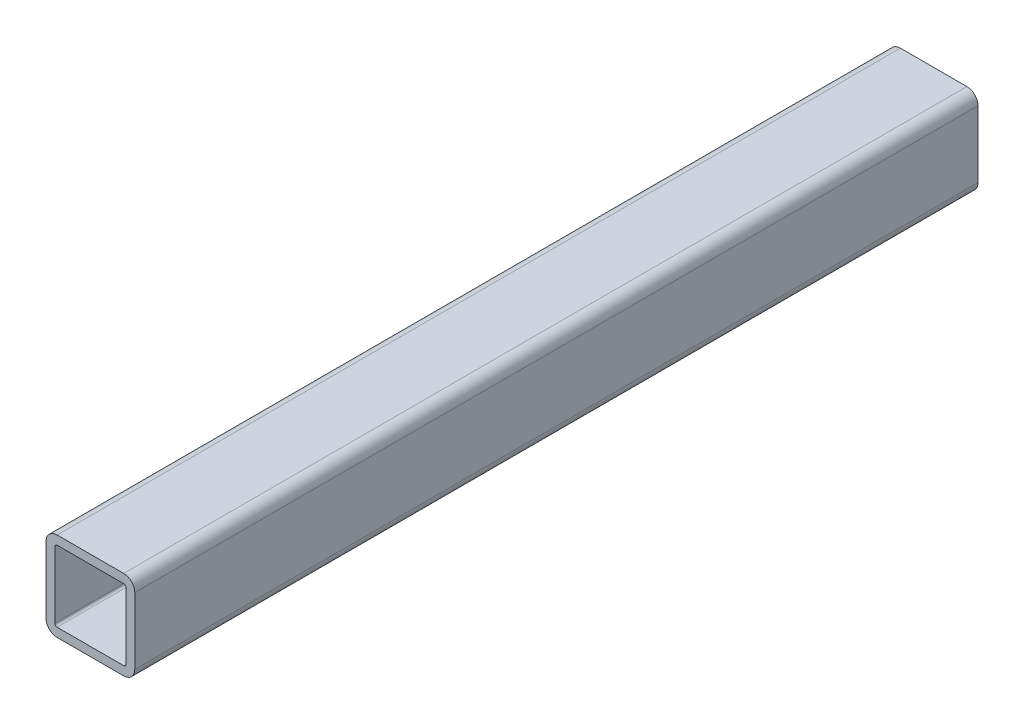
from build123d import *

# Parameters (mm, degrees)
BOSS_EXTRU_1_DEPTH = 95


with BuildPart() as part:
    # Esquisse2 → Boss.-Extru.1 (new, symmetric)
    with BuildSketch(Plane.XY):
        with BuildLine():
            Line((-7.5, 10), (7.5, 10))
            ThreePointArc((7.5, 10), (9.267766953, 9.267766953), (10, 7.5))
            Line((10, 7.5), (10, -7.5))
            ThreePointArc((10, -7.5), (9.267766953, -9.267766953), (7.5, -10))
            Line((7.5, -10), (-7.5, -10))
            ThreePointArc((-7.5, -10), (-9.267766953, -9.267766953), (-10, -7.5))
            Line((-10, -7.5), (-10, 7.5))
            ThreePointArc((-10, 7.5), (-9.267766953, 9.267766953), (-7.5, 10))
        make_face()
        with BuildLine():
            Line((-7.5, 8), (7.5, 8))
            ThreePointArc((7.5, 8), (7.853553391, 7.853553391), (8, 7.5))
            Line((8, 7.5), (8, -7.5))
            ThreePointArc((8, -7.5), (7.853553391, -7.853553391), (7.5, -8))
            Line((7.5, -8), (-7.5, -8))
            ThreePointArc((-7.5, -8), (-7.853553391, -7.853553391), (-8, -7.5))
            Line((-8, -7.5), (-8, 7.5))
            ThreePointArc((-8, 7.5), (-7.853553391, 7.853553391), (-7.5, 8))
        make_face(mode=Mode.SUBTRACT)
    extrude(amount=BOSS_EXTRU_1_DEPTH, both=True)


solid = part.part
